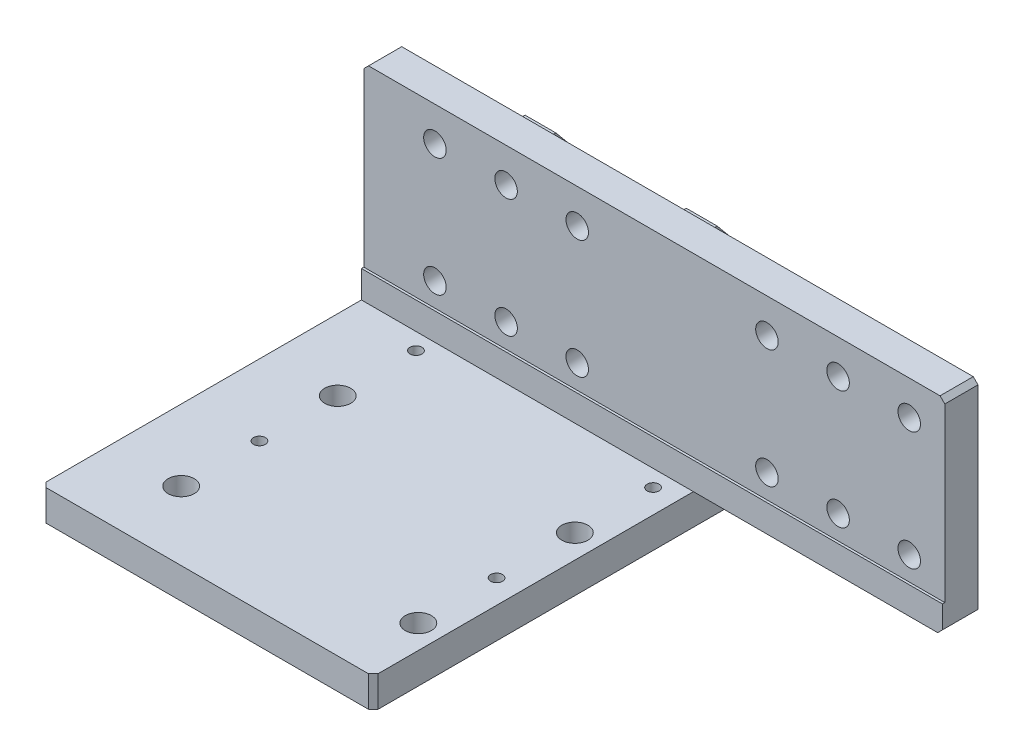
from build123d import *

# Parameters (mm, degrees)
SKETCH_1_W                  = 140
SKETCH_1_H                  = 190
EXTRUDE_1_DEPTH             = 13
SKETCH_2_W                  = 245
SKETCH_2_H                  = 15
EXTRUDE_2_DEPTH             = 86
SKETCH_14_W                 = 245
SKETCH_14_H                 = 74.5
CUT_EXTRUDE_2_DEPTH         = 1
SKETCH_4_W                  = 13
SKETCH_4_H                  = 40
EXTRUDE_3_DEPTH             = 72
EXTRUDE_3_2_DEPTH           = 72
CUT_EXTRUDE_1_DEPTH         = 186.609805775
HOLE_WIZARD_M6_1_AT_2_COUNT = 2
HOLE_WIZARD_M6_1_AT_2_PITCH = 100
HOLE_WIZARD_M6_1_AT_3_COUNT = 2
HOLE_WIZARD_M6_1_AT_3_PITCH = 66
HOLE_WIZARD_M6_1_AT_4_COUNT = 2
HOLE_WIZARD_M6_1_AT_4_PITCH = 132
HOLE_WIZARD_M6_1_AT_5_COUNT = 2
HOLE_WIZARD_M6_1_AT_5_PITCH = 165.601932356
HOLE_WIZARD_M6_1_AT_6_COUNT = 2
HOLE_WIZARD_M6_1_AT_6_PITCH = 119.816526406
SKETCH_9_W                  = 2.5
SKETCH_9_H                  = 13
F_5_0MM_1_AT_2_COUNT        = 2
F_5_0MM_1_AT_2_PITCH        = 100
F_5_0MM_1_AT_3_COUNT        = 2
F_5_0MM_1_AT_3_PITCH        = 66
F_5_0MM_1_AT_4_COUNT        = 2
F_5_0MM_1_AT_4_PITCH        = 119.816526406
HOLE_WIZARD_3_AT_2_COUNT    = 2
HOLE_WIZARD_3_AT_2_PITCH    = 30
HOLE_WIZARD_3_AT_3_COUNT    = 2
HOLE_WIZARD_3_AT_3_PITCH    = 50
HOLE_WIZARD_3_AT_4_COUNT    = 2
HOLE_WIZARD_3_AT_4_PITCH    = 58.309518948
HOLE_WIZARD_3_AT_5_COUNT    = 2
HOLE_WIZARD_3_AT_5_PITCH    = 78.102496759
HOLE_WIZARD_3_AT_6_COUNT    = 2
HOLE_WIZARD_3_AT_6_PITCH    = 60
PATTERN_LINEAR_2_COUNT      = 2
PATTERN_LINEAR_2_PITCH      = 140
CHAMFER_3_SIZE              = 2
CHAMFER_4_SIZE              = 2


with BuildPart() as part:
    # Sketch 1 → Extrude 1 (new body)
    with BuildSketch(Plane(origin=(0, 0, 0), x_dir=(1, 0, 0), z_dir=(0, 1, 0))):
        Rectangle(SKETCH_1_W, SKETCH_1_H)
    extrude(amount=EXTRUDE_1_DEPTH)

    # Sketch 7 → Hole Wizard M6 _ _ _ _ _1 (revolve, cut)
    with BuildSketch(Plane(origin=(-40, 13, -66), x_dir=(0, 0, 1), z_dir=(1, 0, 0))):
        Polygon((0, 0), (0, 13), (3.3, 13), (3.3, 8), (5.5, 8), (5.5, 0), align=None)
    hole_wizard_m6_1 = revolve(axis=Axis((-40, 19.35, -66), (0, -1, 0)), mode=Mode.SUBTRACT)

    # Hole Wizard M6 _ _ _ _ _1 at 2: Hole Wizard M6 _ _ _ _ _1 ×2
    with Locations(*[(i * HOLE_WIZARD_M6_1_AT_2_PITCH, 0, 0) for i in range(1, HOLE_WIZARD_M6_1_AT_2_COUNT)]):
        add(hole_wizard_m6_1, mode=Mode.SUBTRACT)

    # Hole Wizard M6 _ _ _ _ _1 at 3: Hole Wizard M6 _ _ _ _ _1 ×2
    with Locations(*[(0, 0, i * HOLE_WIZARD_M6_1_AT_3_PITCH) for i in range(1, HOLE_WIZARD_M6_1_AT_3_COUNT)]):
        add(hole_wizard_m6_1, mode=Mode.SUBTRACT)

    # Hole Wizard M6 _ _ _ _ _1 at 4: Hole Wizard M6 _ _ _ _ _1 ×2
    with Locations(*[(0, 0, i * HOLE_WIZARD_M6_1_AT_4_PITCH) for i in range(1, HOLE_WIZARD_M6_1_AT_4_COUNT)]):
        add(hole_wizard_m6_1, mode=Mode.SUBTRACT)

    # Hole Wizard M6 _ _ _ _ _1 at 5: Hole Wizard M6 _ _ _ _ _1 ×2
    with Locations(*[Vector(0.6038576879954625, 0, 0.7970921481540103) * (i * HOLE_WIZARD_M6_1_AT_5_PITCH) for i in range(1, HOLE_WIZARD_M6_1_AT_5_COUNT)]):
        add(hole_wizard_m6_1, mode=Mode.SUBTRACT)

    # Hole Wizard M6 _ _ _ _ _1 at 6: Hole Wizard M6 _ _ _ _ _1 ×2
    with Locations(*[Vector(0.8346094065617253, 0, 0.5508422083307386) * (i * HOLE_WIZARD_M6_1_AT_6_PITCH) for i in range(1, HOLE_WIZARD_M6_1_AT_6_COUNT)]):
        add(hole_wizard_m6_1, mode=Mode.SUBTRACT)

    # Sketch 9 → 5.0mm _ _1 (revolve, cut)
    with BuildSketch(Plane(origin=(-40, 13, -33), x_dir=(0, 0, 1), z_dir=(1, 0, 0))):
        with Locations((1.25, 6.5)):
            Rectangle(SKETCH_9_W, SKETCH_9_H)
    f_5_0mm_1 = revolve(axis=Axis((-40, 19.35, -33), (0, -1, 0)), mode=Mode.SUBTRACT)

    # 5.0mm _ _1 at 2: 5.0mm _ _1 ×2
    with Locations(*[(i * F_5_0MM_1_AT_2_PITCH, 0, 0) for i in range(1, F_5_0MM_1_AT_2_COUNT)]):
        add(f_5_0mm_1, mode=Mode.SUBTRACT)

    # 5.0mm _ _1 at 3: 5.0mm _ _1 ×2
    with Locations(*[(0, 0, i * F_5_0MM_1_AT_3_PITCH) for i in range(1, F_5_0MM_1_AT_3_COUNT)]):
        add(f_5_0mm_1, mode=Mode.SUBTRACT)

    # 5.0mm _ _1 at 4: 5.0mm _ _1 ×2
    with Locations(*[Vector(0.8346094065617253, 0, 0.5508422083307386) * (i * F_5_0MM_1_AT_4_PITCH) for i in range(1, F_5_0MM_1_AT_4_COUNT)]):
        add(f_5_0mm_1, mode=Mode.SUBTRACT)

    # Chamfer 4
    chamfer_4_edges = [part.edges().sort_by_distance(p)[0] for p in [
        (70, 6.5, 95),
        (-70, 6.5, 95),
        (-70, 6.5, -95),
        (70, 6.5, -95),
    ]]
    chamfer(chamfer_4_edges, length=CHAMFER_4_SIZE)


with BuildPart() as body_2:
    # Sketch 2 → Extrude 2 (new body)
    with BuildSketch(Plane(origin=(0, 13, 0), x_dir=(1, 0, 0), z_dir=(0, 1, 0))):
        with Locations((52.5, 47.5)):
            Rectangle(SKETCH_2_W, SKETCH_2_H)
    extrude(amount=EXTRUDE_2_DEPTH)

    # Sketch 14 → Cut-Extrude 2 (cut)
    with BuildSketch(Plane.XY.offset(-40)):
        with Locations((52.5, 61.75)):
            Rectangle(SKETCH_14_W, SKETCH_14_H)
    extrude(amount=-CUT_EXTRUDE_2_DEPTH, mode=Mode.SUBTRACT)

    # Sketch 16 → Hole Wizard 3 (revolve, cut)
    with BuildSketch(Plane(origin=(-40, 84.5, -41), x_dir=(0, -1, 0), z_dir=(1, 0, 0))):
        Polygon((0, 0), (0, 55.652366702), (2.75, 54), (2.75, 8), (4.75, 8), (4.75, 0), align=None)
    hole_wizard_3 = revolve(axis=Axis((-40, 84.5, -29.689124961), (0, 0, -1)), mode=Mode.SUBTRACT)

    # Hole Wizard 3 at 2: Hole Wizard 3 ×2
    with Locations(*[(i * HOLE_WIZARD_3_AT_2_PITCH, 0, 0) for i in range(1, HOLE_WIZARD_3_AT_2_COUNT)]):
        add(hole_wizard_3, mode=Mode.SUBTRACT)

    # Hole Wizard 3 at 3: Hole Wizard 3 ×2
    with Locations(*[(0, -i * HOLE_WIZARD_3_AT_3_PITCH, 0) for i in range(1, HOLE_WIZARD_3_AT_3_COUNT)]):
        add(hole_wizard_3, mode=Mode.SUBTRACT)

    # Hole Wizard 3 at 4: Hole Wizard 3 ×2
    with Locations(*[Vector(0.5144957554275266, -0.8574929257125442, 0) * (i * HOLE_WIZARD_3_AT_4_PITCH) for i in range(1, HOLE_WIZARD_3_AT_4_COUNT)]):
        add(hole_wizard_3, mode=Mode.SUBTRACT)

    # Hole Wizard 3 at 5: Hole Wizard 3 ×2
    with Locations(*[Vector(0.7682212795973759, -0.6401843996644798, 0) * (i * HOLE_WIZARD_3_AT_5_PITCH) for i in range(1, HOLE_WIZARD_3_AT_5_COUNT)]):
        add(hole_wizard_3, mode=Mode.SUBTRACT)

    # Hole Wizard 3 at 6: Hole Wizard 3 ×2
    with Locations(*[(i * HOLE_WIZARD_3_AT_6_PITCH, 0, 0) for i in range(1, HOLE_WIZARD_3_AT_6_COUNT)]):
        add(hole_wizard_3, mode=Mode.SUBTRACT)

    # Pattern Linear 2: Hole Wizard 3 ×2
    with Locations(*[(i * PATTERN_LINEAR_2_PITCH, 0, 0) for i in range(1, PATTERN_LINEAR_2_COUNT)]):
        add(hole_wizard_3, mode=Mode.SUBTRACT)

    # Pattern Linear 2 copy 1 sketch → Pattern Linear 2 copy 1 (revolve, cut)
    with BuildSketch(Plane(origin=(130, 84.5, -41), x_dir=(0, -1, 0), z_dir=(1, 0, 0))):
        Polygon((0, 0), (0, 55.652366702), (2.75, 54), (2.75, 8), (4.75, 8), (4.75, 0), align=None)
    revolve(axis=Axis((130, 84.5, -29.689124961), (0, 0, -1)), mode=Mode.SUBTRACT)

    # Pattern Linear 2 copy 2 sketch → Pattern Linear 2 copy 2 (revolve, cut)
    with BuildSketch(Plane(origin=(100, 34.5, -41), x_dir=(0, -1, 0), z_dir=(1, 0, 0))):
        Polygon((0, 0), (0, 55.652366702), (2.75, 54), (2.75, 8), (4.75, 8), (4.75, 0), align=None)
    revolve(axis=Axis((100, 34.5, -29.689124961), (0, 0, -1)), mode=Mode.SUBTRACT)

    # Pattern Linear 2 copy 3 sketch → Pattern Linear 2 copy 3 (revolve, cut)
    with BuildSketch(Plane(origin=(130, 34.5, -41), x_dir=(0, -1, 0), z_dir=(1, 0, 0))):
        Polygon((0, 0), (0, 55.652366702), (2.75, 54), (2.75, 8), (4.75, 8), (4.75, 0), align=None)
    revolve(axis=Axis((130, 34.5, -29.689124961), (0, 0, -1)), mode=Mode.SUBTRACT)

    # Pattern Linear 2 copy 4 sketch → Pattern Linear 2 copy 4 (revolve, cut)
    with BuildSketch(Plane(origin=(160, 34.5, -41), x_dir=(0, -1, 0), z_dir=(1, 0, 0))):
        Polygon((0, 0), (0, 55.652366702), (2.75, 54), (2.75, 8), (4.75, 8), (4.75, 0), align=None)
    revolve(axis=Axis((160, 34.5, -29.689124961), (0, 0, -1)), mode=Mode.SUBTRACT)

    # Pattern Linear 2 copy 5 sketch → Pattern Linear 2 copy 5 (revolve, cut)
    with BuildSketch(Plane(origin=(160, 84.5, -41), x_dir=(0, -1, 0), z_dir=(1, 0, 0))):
        Polygon((0, 0), (0, 55.652366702), (2.75, 54), (2.75, 8), (4.75, 8), (4.75, 0), align=None)
    revolve(axis=Axis((160, 84.5, -29.689124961), (0, 0, -1)), mode=Mode.SUBTRACT)

    # Chamfer 3
    chamfer_3_edges = [body_2.edges().sort_by_distance(p)[0] for p in [
        (175, 99, -48),
        (-70, 99, -48),
        (175, 13, -47.5),
    ]]
    chamfer(chamfer_3_edges, length=CHAMFER_3_SIZE)


with BuildPart() as body_3:
    # Sketch 4 → Extrude 3 (new body)
    with BuildSketch(Plane(origin=(0, 13, 0), x_dir=(1, 0, 0), z_dir=(0, 1, 0))):
        with Locations((-24.5, 75)):
            Rectangle(SKETCH_4_W, SKETCH_4_H)
    extrude(amount=EXTRUDE_3_DEPTH)


with BuildPart() as body_4:
    # Sketch 4 → Extrude 3 2 (new body)
    with BuildSketch(Plane(origin=(0, 13, 0), x_dir=(1, 0, 0), z_dir=(0, 1, 0))):
        with Locations((43.5, 75)):
            Rectangle(SKETCH_4_W, SKETCH_4_H)
    extrude(amount=EXTRUDE_3_2_DEPTH)


with BuildPart() as cut_extrude_1_tool:
    # Sketch 5 → Cut-Extrude 1 (new, through all)
    with BuildSketch(Plane(origin=(50, 0, 0), x_dir=(0, 0, -1), z_dir=(1, 0, 0))):
        Polygon((95, 85), (95, 55), (70, 85), align=None)
    extrude(amount=-CUT_EXTRUDE_1_DEPTH)


with BuildPart() as body_3_1:
    add(body_3.part)

    # Cut-Extrude 1: cut by cut_extrude_1_tool
    add(cut_extrude_1_tool.part, mode=Mode.SUBTRACT)


with BuildPart() as body_4_1:
    add(body_4.part)

    # Cut-Extrude 1: cut by cut_extrude_1_tool
    add(cut_extrude_1_tool.part, mode=Mode.SUBTRACT)


solid = Compound([part.part, body_2.part, body_3_1.part, body_4_1.part])
